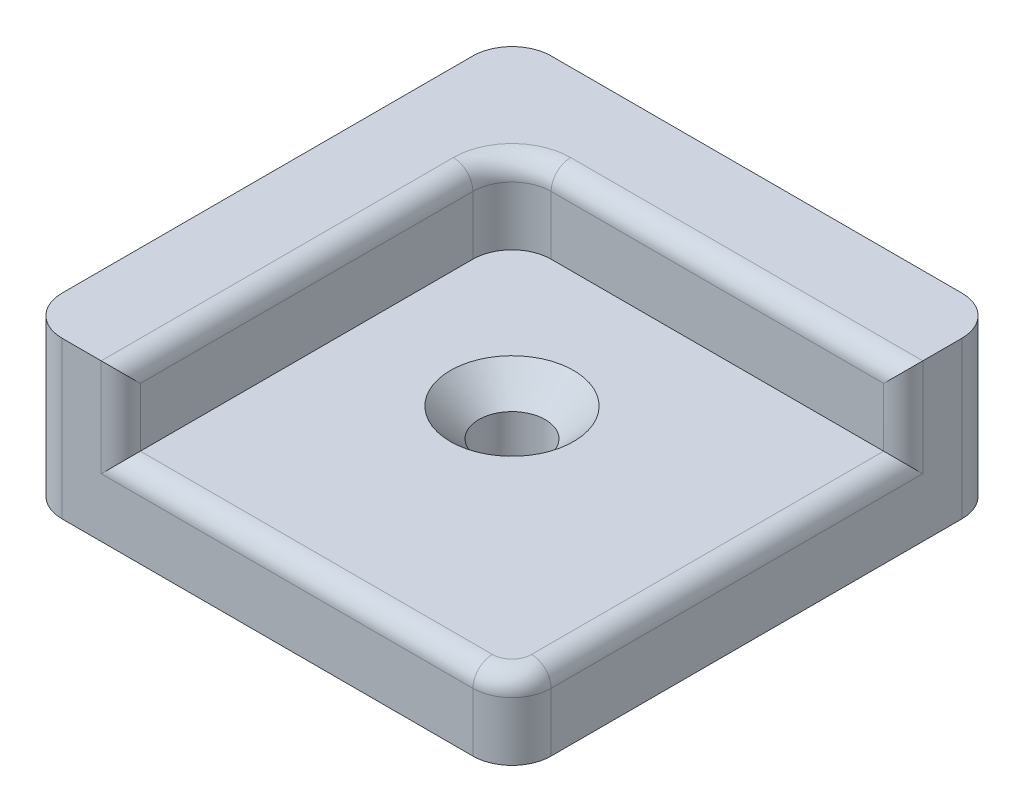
from build123d import *

# Parameters (mm, degrees)
SKETCH2_W                                           = 25
SKETCH2_H                                           = 25
BOSS_EXTRUDE1_DEPTH                                 = 4
CUT_EXTRUDE1_DEPTH                                  = 4
FILLET2_R                                           = 2
FILLET4_R                                           = 1
CSK_FOR_M3_COUNTERSUNK_FLAT_HEAD_SCREW1_D           = 3.4
CSK_FOR_M3_COUNTERSUNK_FLAT_HEAD_SCREW1_CSINK_D     = 6.3
CSK_FOR_M3_COUNTERSUNK_FLAT_HEAD_SCREW1_CSINK_ANGLE = 90


with BuildPart() as part:
    # Sketch2 → Boss-Extrude1 (new, symmetric)
    with BuildSketch(Plane(origin=(0, 0, 0), x_dir=(1, 0, 0), z_dir=(0, 1, 0))):
        Rectangle(SKETCH2_W, SKETCH2_H)
    extrude(amount=BOSS_EXTRUDE1_DEPTH, both=True)

    # Sketch3 → Cut-Extrude1 (cut)
    with BuildSketch(Plane(origin=(0, 4, 0), x_dir=(1, 0, 0), z_dir=(0, 1, 0))):
        with BuildLine():
            Line((-7.5, -12.5), (-7.5, 5.5))
            ThreePointArc((-7.5, 5.5), (-6.914213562, 6.914213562), (-5.5, 7.5))
            Line((-5.5, 7.5), (12.5, 7.5))
            Line((12.5, 7.5), (12.5, -12.5))
            Line((12.5, -12.5), (-7.5, -12.5))
        make_face()
    extrude(amount=-CUT_EXTRUDE1_DEPTH, mode=Mode.SUBTRACT)

    # Fillet2
    fillet2_edges = [part.edges().sort_by_distance(p)[0] for p in [
        (12.5, -2, 12.5),
        (-12.5, 0, 12.5),
        (-12.5, 0, -12.5),
        (12.5, 0, -12.5),
    ]]
    fillet(fillet2_edges, radius=FILLET2_R)

    # Fillet4
    fillet4_edges = [part.edges().sort_by_distance(p)[0] for p in [
        (1.5, 0, 12.5),
        (-7.5, 2, 12.5),
        (12.5, 2, -7.5),
        (3.5, 4, -7.5),
        (-6.914213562, 4, -6.914213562),
        (-7.5, 4, 3.5),
        (12.5, 0, 1.5),
        (11.914213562, 0, 11.914213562),
    ]]
    fillet(fillet4_edges, radius=FILLET4_R)

    # CSK for M3 Countersunk Flat Head Screw1 (through all)
    with Locations(Plane(origin=(0, 0, 0), x_dir=(1, 0, 0), z_dir=(0, 1, 0))):
        with Locations((0, 0)):
            CounterSinkHole(CSK_FOR_M3_COUNTERSUNK_FLAT_HEAD_SCREW1_D / 2, CSK_FOR_M3_COUNTERSUNK_FLAT_HEAD_SCREW1_CSINK_D / 2, counter_sink_angle=CSK_FOR_M3_COUNTERSUNK_FLAT_HEAD_SCREW1_CSINK_ANGLE)


solid = part.part
